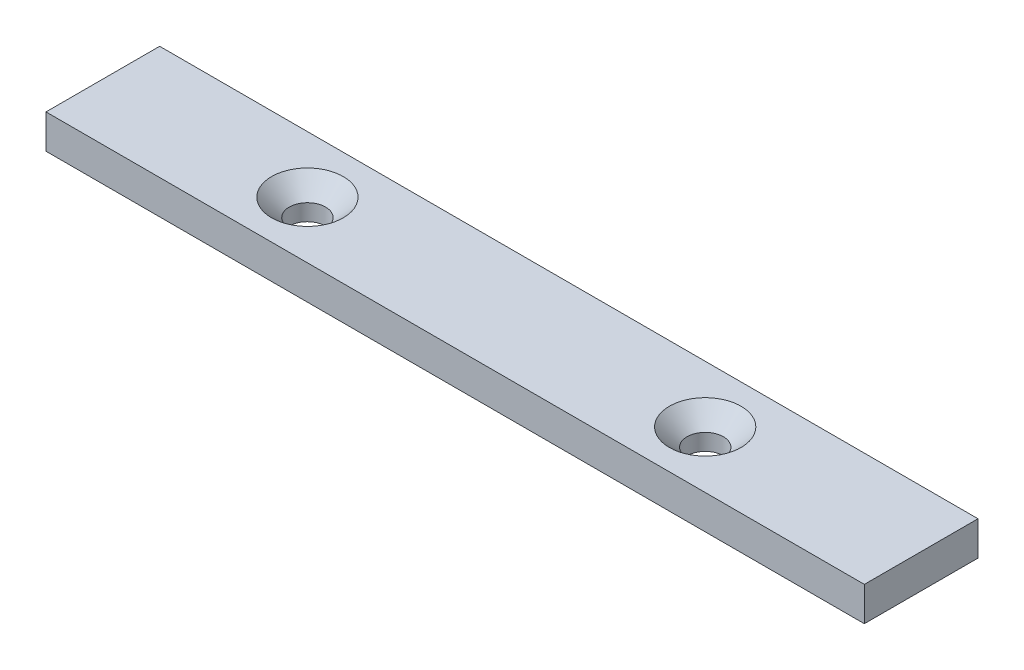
from build123d import *

# Parameters (mm, degrees)
SKETCH1_W                                      = 144
SKETCH1_H                                      = 20
BOSS_EXTRUDE1_DEPTH                            = 6
CSK_FOR_M6_FLAT_HEAD_MACHINE_SCREW1_AT_2_COUNT = 2
CSK_FOR_M6_FLAT_HEAD_MACHINE_SCREW1_AT_2_PITCH = 70


with BuildPart() as part:
    # Sketch1 → Boss-Extrude1 (new body)
    with BuildSketch(Plane(origin=(0, 0, 0), x_dir=(1, 0, 0), z_dir=(0, 1, 0))):
        Rectangle(SKETCH1_W, SKETCH1_H)
    extrude(amount=BOSS_EXTRUDE1_DEPTH)

    # Sketch2 → CSK for M6 Flat Head Machine Screw1 (revolve, cut)
    with BuildSketch(Plane(origin=(-36, 6, 0), x_dir=(0, 0, 1), z_dir=(1, 0, 0))):
        Polygon((0, 0), (0, 6), (3.2, 6), (3.2, 3.1), (6.3, 0), align=None)
    csk_for_m6_flat_head_machine_screw1 = revolve(axis=Axis((-36, 12.35, 0), (0, -1, 0)), mode=Mode.SUBTRACT)

    # CSK for M6 Flat Head Machine Screw1 at 2: CSK for M6 Flat Head Machine Screw1 ×2
    with Locations(*[(i * CSK_FOR_M6_FLAT_HEAD_MACHINE_SCREW1_AT_2_PITCH, 0, 0) for i in range(1, CSK_FOR_M6_FLAT_HEAD_MACHINE_SCREW1_AT_2_COUNT)]):
        add(csk_for_m6_flat_head_machine_screw1, mode=Mode.SUBTRACT)


solid = part.part
